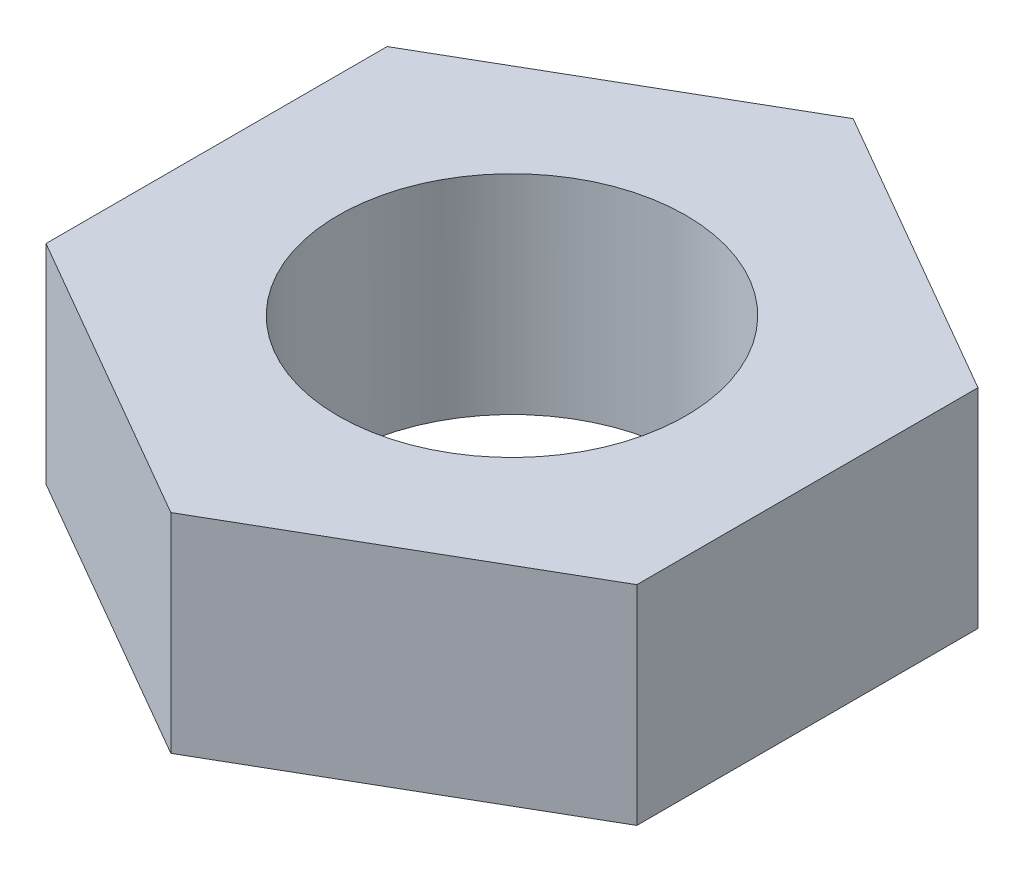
ISO-10303-21;
HEADER;
FILE_DESCRIPTION(('STEP AP214'),'2;1');
FILE_NAME('part.step','',(''),(''),'','','');
FILE_SCHEMA(('AUTOMOTIVE_DESIGN { 1 0 10303 214 1 1 1 1 }'));
ENDSEC;
DATA;
#1=APPLICATION_CONTEXT('core data for automotive mechanical design processes');
#2=APPLICATION_PROTOCOL_DEFINITION('international standard','automotive_design',2000,#1);
#3=PRODUCT_CONTEXT('',#1,'mechanical');
#4=PRODUCT('Part','Part','',(#3));
#5=PRODUCT_RELATED_PRODUCT_CATEGORY('part','',(#4));
#6=PRODUCT_DEFINITION_FORMATION('','',#4);
#7=PRODUCT_DEFINITION_CONTEXT('part definition',#1,'design');
#8=PRODUCT_DEFINITION('design','',#6,#7);
#9=PRODUCT_DEFINITION_SHAPE('','',#8);
#10=(LENGTH_UNIT() NAMED_UNIT(*) SI_UNIT(.MILLI.,.METRE.));
#11=(NAMED_UNIT(*) PLANE_ANGLE_UNIT() SI_UNIT($,.RADIAN.));
#12=(NAMED_UNIT(*) SI_UNIT($,.STERADIAN.) SOLID_ANGLE_UNIT());
#13=UNCERTAINTY_MEASURE_WITH_UNIT(LENGTH_MEASURE(1.E-05),#10,'distance_accuracy_value','');
#14=(GEOMETRIC_REPRESENTATION_CONTEXT(3) GLOBAL_UNCERTAINTY_ASSIGNED_CONTEXT((#13)) GLOBAL_UNIT_ASSIGNED_CONTEXT((#10,
#11,#12)) REPRESENTATION_CONTEXT('',''));
#15=CARTESIAN_POINT('',(0.,0.,0.));
#16=DIRECTION('',(0.,0.,1.));
#17=DIRECTION('',(1.,0.,0.));
#18=AXIS2_PLACEMENT_3D('',#15,#16,#17);
#19=CARTESIAN_POINT('',(8.5,6.,-4.90747728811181));
#20=DIRECTION('',(-0.5,0.,0.866025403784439));
#21=DIRECTION('',(0.866025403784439,0.,0.5));
#22=AXIS2_PLACEMENT_3D('',#19,#20,#21);
#23=PLANE('',#22);
#24=DIRECTION('',(-0.866025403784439,0.,-0.5));
#25=VECTOR('',#24,1.);
#26=CARTESIAN_POINT('',(8.5,0.,-4.90747728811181));
#27=LINE('',#26,#25);
#28=CARTESIAN_POINT('',(8.5,0.,-4.90747728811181));
#29=VERTEX_POINT('',#28);
#30=CARTESIAN_POINT('',(0.,0.,-9.81495457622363));
#31=VERTEX_POINT('',#30);
#32=EDGE_CURVE('E105',#29,#31,#27,.T.);
#33=ORIENTED_EDGE('',*,*,#32,.T.);
#34=DIRECTION('',(0.,-1.,0.));
#35=VECTOR('',#34,1.);
#36=CARTESIAN_POINT('',(0.,6.,-9.81495457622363));
#37=LINE('',#36,#35);
#38=CARTESIAN_POINT('',(0.,6.,-9.81495457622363));
#39=VERTEX_POINT('',#38);
#40=EDGE_CURVE('E9',#39,#31,#37,.T.);
#41=ORIENTED_EDGE('',*,*,#40,.F.);
#42=DIRECTION('',(-0.866025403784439,0.,-0.5));
#43=VECTOR('',#42,1.);
#44=CARTESIAN_POINT('',(8.5,6.,-4.90747728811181));
#45=LINE('',#44,#43);
#46=CARTESIAN_POINT('',(8.5,6.,-4.90747728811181));
#47=VERTEX_POINT('',#46);
#48=EDGE_CURVE('E122',#47,#39,#45,.T.);
#49=ORIENTED_EDGE('',*,*,#48,.F.);
#50=DIRECTION('',(0.,-1.,0.));
#51=VECTOR('',#50,1.);
#52=CARTESIAN_POINT('',(8.5,6.,-4.90747728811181));
#53=LINE('',#52,#51);
#54=EDGE_CURVE('E101',#47,#29,#53,.T.);
#55=ORIENTED_EDGE('',*,*,#54,.T.);
#56=EDGE_LOOP('',(#33,#41,#49,#55));
#57=FACE_BOUND('',#56,.T.);
#58=ADVANCED_FACE('F15',(#57),#23,.F.);
#59=CARTESIAN_POINT('',(0.,6.,-9.81495457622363));
#60=DIRECTION('',(0.5,0.,0.866025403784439));
#61=DIRECTION('',(0.866025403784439,0.,-0.5));
#62=AXIS2_PLACEMENT_3D('',#59,#60,#61);
#63=PLANE('',#62);
#64=DIRECTION('',(-0.866025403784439,0.,0.5));
#65=VECTOR('',#64,1.);
#66=CARTESIAN_POINT('',(0.,0.,-9.81495457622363));
#67=LINE('',#66,#65);
#68=CARTESIAN_POINT('',(-8.5,0.,-4.9074772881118));
#69=VERTEX_POINT('',#68);
#70=EDGE_CURVE('E109',#31,#69,#67,.T.);
#71=ORIENTED_EDGE('',*,*,#70,.T.);
#72=DIRECTION('',(0.,-1.,0.));
#73=VECTOR('',#72,1.);
#74=CARTESIAN_POINT('',(-8.5,6.,-4.9074772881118));
#75=LINE('',#74,#73);
#76=CARTESIAN_POINT('',(-8.5,6.,-4.9074772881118));
#77=VERTEX_POINT('',#76);
#78=EDGE_CURVE('E24',#77,#69,#75,.T.);
#79=ORIENTED_EDGE('',*,*,#78,.F.);
#80=DIRECTION('',(-0.866025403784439,0.,0.5));
#81=VECTOR('',#80,1.);
#82=CARTESIAN_POINT('',(0.,6.,-9.81495457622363));
#83=LINE('',#82,#81);
#84=EDGE_CURVE('E69',#39,#77,#83,.T.);
#85=ORIENTED_EDGE('',*,*,#84,.F.);
#86=ORIENTED_EDGE('',*,*,#40,.T.);
#87=EDGE_LOOP('',(#71,#79,#85,#86));
#88=FACE_BOUND('',#87,.T.);
#89=ADVANCED_FACE('F153',(#88),#63,.F.);
#90=CARTESIAN_POINT('',(-8.5,6.,-4.9074772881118));
#91=DIRECTION('',(1.,0.,0.));
#92=DIRECTION('',(0.,0.,-1.));
#93=AXIS2_PLACEMENT_3D('',#90,#91,#92);
#94=PLANE('',#93);
#95=DIRECTION('',(0.,0.,1.));
#96=VECTOR('',#95,1.);
#97=CARTESIAN_POINT('',(-8.5,0.,-4.9074772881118));
#98=LINE('',#97,#96);
#99=CARTESIAN_POINT('',(-8.5,0.,4.90747728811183));
#100=VERTEX_POINT('',#99);
#101=EDGE_CURVE('E113',#69,#100,#98,.T.);
#102=ORIENTED_EDGE('',*,*,#101,.T.);
#103=DIRECTION('',(0.,-1.,0.));
#104=VECTOR('',#103,1.);
#105=CARTESIAN_POINT('',(-8.5,6.,4.90747728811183));
#106=LINE('',#105,#104);
#107=CARTESIAN_POINT('',(-8.5,6.,4.90747728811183));
#108=VERTEX_POINT('',#107);
#109=EDGE_CURVE('E93',#108,#100,#106,.T.);
#110=ORIENTED_EDGE('',*,*,#109,.F.);
#111=DIRECTION('',(0.,0.,1.));
#112=VECTOR('',#111,1.);
#113=CARTESIAN_POINT('',(-8.5,6.,-4.9074772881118));
#114=LINE('',#113,#112);
#115=EDGE_CURVE('E82',#77,#108,#114,.T.);
#116=ORIENTED_EDGE('',*,*,#115,.F.);
#117=ORIENTED_EDGE('',*,*,#78,.T.);
#118=EDGE_LOOP('',(#102,#110,#116,#117));
#119=FACE_BOUND('',#118,.T.);
#120=ADVANCED_FACE('F132',(#119),#94,.F.);
#121=CARTESIAN_POINT('',(-8.5,6.,4.90747728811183));
#122=DIRECTION('',(0.5,0.,-0.866025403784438));
#123=DIRECTION('',(-0.866025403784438,0.,-0.5));
#124=AXIS2_PLACEMENT_3D('',#121,#122,#123);
#125=PLANE('',#124);
#126=DIRECTION('',(0.866025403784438,0.,0.5));
#127=VECTOR('',#126,1.);
#128=CARTESIAN_POINT('',(-8.5,0.,4.90747728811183));
#129=LINE('',#128,#127);
#130=CARTESIAN_POINT('',(0.,0.,9.81495457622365));
#131=VERTEX_POINT('',#130);
#132=EDGE_CURVE('E91',#100,#131,#129,.T.);
#133=ORIENTED_EDGE('',*,*,#132,.T.);
#134=DIRECTION('',(0.,-1.,0.));
#135=VECTOR('',#134,1.);
#136=CARTESIAN_POINT('',(0.,6.,9.81495457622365));
#137=LINE('',#136,#135);
#138=CARTESIAN_POINT('',(0.,6.,9.81495457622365));
#139=VERTEX_POINT('',#138);
#140=EDGE_CURVE('E88',#139,#131,#137,.T.);
#141=ORIENTED_EDGE('',*,*,#140,.F.);
#142=DIRECTION('',(0.866025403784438,0.,0.5));
#143=VECTOR('',#142,1.);
#144=CARTESIAN_POINT('',(-8.5,6.,4.90747728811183));
#145=LINE('',#144,#143);
#146=EDGE_CURVE('E76',#108,#139,#145,.T.);
#147=ORIENTED_EDGE('',*,*,#146,.F.);
#148=ORIENTED_EDGE('',*,*,#109,.T.);
#149=EDGE_LOOP('',(#133,#141,#147,#148));
#150=FACE_BOUND('',#149,.T.);
#151=ADVANCED_FACE('F89',(#150),#125,.F.);
#152=CARTESIAN_POINT('',(0.,6.,9.81495457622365));
#153=DIRECTION('',(-0.5,0.,-0.866025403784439));
#154=DIRECTION('',(-0.866025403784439,0.,0.5));
#155=AXIS2_PLACEMENT_3D('',#152,#153,#154);
#156=PLANE('',#155);
#157=DIRECTION('',(0.866025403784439,0.,-0.5));
#158=VECTOR('',#157,1.);
#159=CARTESIAN_POINT('',(0.,0.,9.81495457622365));
#160=LINE('',#159,#158);
#161=CARTESIAN_POINT('',(8.5,0.,4.90747728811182));
#162=VERTEX_POINT('',#161);
#163=EDGE_CURVE('E55',#131,#162,#160,.T.);
#164=ORIENTED_EDGE('',*,*,#163,.T.);
#165=DIRECTION('',(0.,-1.,0.));
#166=VECTOR('',#165,1.);
#167=CARTESIAN_POINT('',(8.5,6.,4.90747728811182));
#168=LINE('',#167,#166);
#169=CARTESIAN_POINT('',(8.5,6.,4.90747728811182));
#170=VERTEX_POINT('',#169);
#171=EDGE_CURVE('E94',#170,#162,#168,.T.);
#172=ORIENTED_EDGE('',*,*,#171,.F.);
#173=DIRECTION('',(0.866025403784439,0.,-0.5));
#174=VECTOR('',#173,1.);
#175=CARTESIAN_POINT('',(0.,6.,9.81495457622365));
#176=LINE('',#175,#174);
#177=EDGE_CURVE('E80',#139,#170,#176,.T.);
#178=ORIENTED_EDGE('',*,*,#177,.F.);
#179=ORIENTED_EDGE('',*,*,#140,.T.);
#180=EDGE_LOOP('',(#164,#172,#178,#179));
#181=FACE_BOUND('',#180,.T.);
#182=ADVANCED_FACE('F96',(#181),#156,.F.);
#183=CARTESIAN_POINT('',(8.5,6.,4.90747728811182));
#184=DIRECTION('',(-1.,0.,0.));
#185=DIRECTION('',(0.,0.,1.));
#186=AXIS2_PLACEMENT_3D('',#183,#184,#185);
#187=PLANE('',#186);
#188=DIRECTION('',(0.,0.,-1.));
#189=VECTOR('',#188,1.);
#190=CARTESIAN_POINT('',(8.5,0.,4.90747728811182));
#191=LINE('',#190,#189);
#192=EDGE_CURVE('E61',#162,#29,#191,.T.);
#193=ORIENTED_EDGE('',*,*,#192,.T.);
#194=ORIENTED_EDGE('',*,*,#54,.F.);
#195=DIRECTION('',(0.,0.,-1.));
#196=VECTOR('',#195,1.);
#197=CARTESIAN_POINT('',(8.5,6.,4.90747728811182));
#198=LINE('',#197,#196);
#199=EDGE_CURVE('E32',#170,#47,#198,.T.);
#200=ORIENTED_EDGE('',*,*,#199,.F.);
#201=ORIENTED_EDGE('',*,*,#171,.T.);
#202=EDGE_LOOP('',(#193,#194,#200,#201));
#203=FACE_BOUND('',#202,.T.);
#204=ADVANCED_FACE('F139',(#203),#187,.F.);
#205=CARTESIAN_POINT('',(0.,6.,-9.81495457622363));
#206=DIRECTION('',(0.,1.,0.));
#207=DIRECTION('',(0.,0.,1.));
#208=AXIS2_PLACEMENT_3D('',#205,#206,#207);
#209=PLANE('',#208);
#210=CARTESIAN_POINT('',(0.,6.,0.));
#211=DIRECTION('',(0.,1.,0.));
#212=DIRECTION('',(0.,0.,1.));
#213=AXIS2_PLACEMENT_3D('',#210,#211,#212);
#214=CIRCLE('',#213,5.);
#215=CARTESIAN_POINT('',(0.,6.,5.00000000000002));
#216=VERTEX_POINT('',#215);
#217=EDGE_CURVE('E110',#216,#216,#214,.T.);
#218=ORIENTED_EDGE('',*,*,#217,.F.);
#219=EDGE_LOOP('',(#218));
#220=FACE_BOUND('',#219,.T.);
#221=ORIENTED_EDGE('',*,*,#48,.T.);
#222=ORIENTED_EDGE('',*,*,#84,.T.);
#223=ORIENTED_EDGE('',*,*,#115,.T.);
#224=ORIENTED_EDGE('',*,*,#146,.T.);
#225=ORIENTED_EDGE('',*,*,#177,.T.);
#226=ORIENTED_EDGE('',*,*,#199,.T.);
#227=EDGE_LOOP('',(#221,#222,#223,#224,#225,#226));
#228=FACE_BOUND('',#227,.T.);
#229=ADVANCED_FACE('F78',(#220,#228),#209,.T.);
#230=CARTESIAN_POINT('',(0.,0.,-9.81495457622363));
#231=DIRECTION('',(0.,1.,0.));
#232=DIRECTION('',(0.,0.,1.));
#233=AXIS2_PLACEMENT_3D('',#230,#231,#232);
#234=PLANE('',#233);
#235=CARTESIAN_POINT('',(0.,0.,0.));
#236=DIRECTION('',(0.,-1.,0.));
#237=DIRECTION('',(0.,0.,-1.));
#238=AXIS2_PLACEMENT_3D('',#235,#236,#237);
#239=CIRCLE('',#238,5.);
#240=CARTESIAN_POINT('',(0.,0.,-4.99999999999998));
#241=VERTEX_POINT('',#240);
#242=EDGE_CURVE('E228',#241,#241,#239,.T.);
#243=ORIENTED_EDGE('',*,*,#242,.F.);
#244=EDGE_LOOP('',(#243));
#245=FACE_BOUND('',#244,.T.);
#246=ORIENTED_EDGE('',*,*,#32,.F.);
#247=ORIENTED_EDGE('',*,*,#192,.F.);
#248=ORIENTED_EDGE('',*,*,#163,.F.);
#249=ORIENTED_EDGE('',*,*,#132,.F.);
#250=ORIENTED_EDGE('',*,*,#101,.F.);
#251=ORIENTED_EDGE('',*,*,#70,.F.);
#252=EDGE_LOOP('',(#246,#247,#248,#249,#250,#251));
#253=FACE_BOUND('',#252,.T.);
#254=ADVANCED_FACE('F135',(#245,#253),#234,.F.);
#255=CARTESIAN_POINT('',(0.,0.,0.));
#256=DIRECTION('',(0.,-1.,0.));
#257=DIRECTION('',(0.,0.,-1.));
#258=AXIS2_PLACEMENT_3D('',#255,#256,#257);
#259=CYLINDRICAL_SURFACE('',#258,5.);
#260=ORIENTED_EDGE('',*,*,#217,.T.);
#261=EDGE_LOOP('',(#260));
#262=FACE_BOUND('',#261,.T.);
#263=ORIENTED_EDGE('',*,*,#242,.T.);
#264=EDGE_LOOP('',(#263));
#265=FACE_BOUND('',#264,.T.);
#266=ADVANCED_FACE('F211',(#262,#265),#259,.F.);
#267=CLOSED_SHELL('',(#58,#89,#120,#151,#182,#204,#229,#254,#266));
#268=MANIFOLD_SOLID_BREP('B1',#267);
#269=ADVANCED_BREP_SHAPE_REPRESENTATION('',(#18,#268),#14);
#270=SHAPE_DEFINITION_REPRESENTATION(#9,#269);
ENDSEC;
END-ISO-10303-21;
